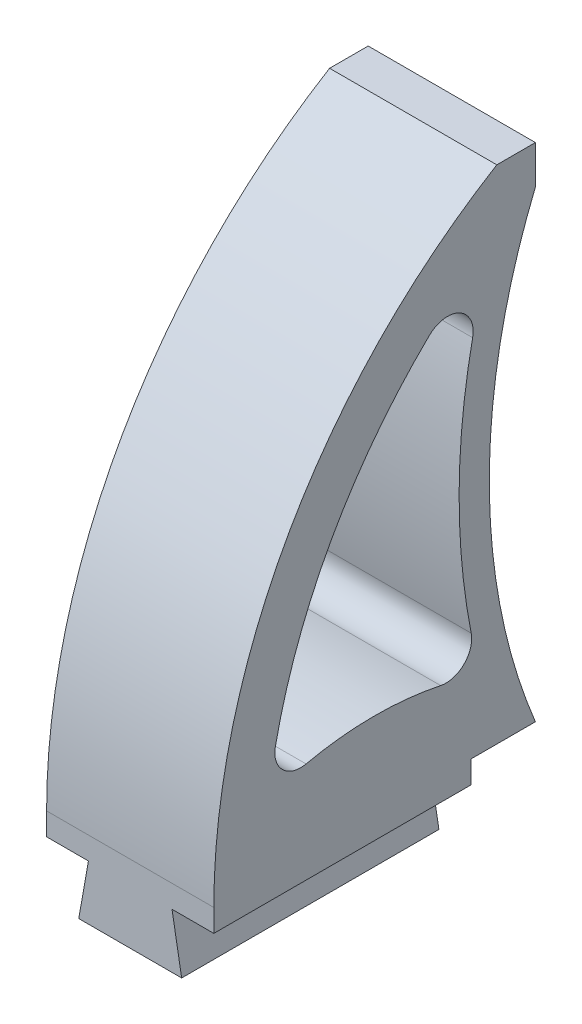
from build123d import *

# Parameters (mm, degrees)
EXTRUDE_1_DEPTH     = 6.5
CUT_EXTRUDE_1_DEPTH = 50.070826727
CUT_EXTRUDE_2_DEPTH = 49.059297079


with BuildPart() as part:
    # Sketch 1 → Extrude 1 (new, symmetric)
    with BuildSketch(Plane(origin=(0, 0, 0), x_dir=(0, 0, -1), z_dir=(1, 0, 0))):
        with BuildLine():
            Line((-20, -3.278350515), (-20, 2.721649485))
            ThreePointArc((-20, 2.721649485), (-14.12072336, 25.110262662), (2, 41.721649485))
            Line((2, 41.721649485), (5, 41.721649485))
            Line((5, 41.721649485), (5, 38.721649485))
            ThreePointArc((5, 38.721649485), (1.416586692, 20.721649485), (5, 2.721649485))
            Line((5, 2.721649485), (0, 2.721649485))
            Line((0, 2.721649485), (0, -3.278350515))
            Line((0, -3.278350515), (-20, -3.278350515))
        make_face()
    extrude(amount=EXTRUDE_1_DEPTH, both=True)

    # Sketch 4 → Cut-Extrude 1 (cut, through all)
    with BuildSketch(Plane.XY.offset(20)):
        Polygon((-6.5, -3.278350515), (-4, -3.278350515), (-3.25, 0.975110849), (-6.5, 0.975110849), align=None)
        Polygon((6.5, 0.975110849), (3.25, 0.975110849), (4, -3.278350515), (6.5, -3.278350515), align=None)
    extrude(amount=-CUT_EXTRUDE_1_DEPTH, mode=Mode.SUBTRACT)

    # Sketch 5 → Cut-Extrude 2 (cut, through all)
    with BuildSketch(Plane(origin=(6.5, 0, 0), x_dir=(0, 0, -1), z_dir=(1, 0, 0))):
        with BuildLine():
            ThreePointArc((-12.830263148, 8.800744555), (-7.599723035, 9.375388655), (-2.36476499, 8.842490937))
            ThreePointArc((-2.36476499, 8.842490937), (-0.54885061, 9.376570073), (0.008524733, 11.185469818))
            ThreePointArc((0.008524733, 11.185469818), (-0.928892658, 21.110663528), (0.121422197, 31.024545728))
            ThreePointArc((0.121422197, 31.024545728), (-0.869135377, 33.182951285), (-3.22370373, 32.873230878))
            ThreePointArc((-3.22370373, 32.873230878), (-10.858536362, 22.922772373), (-15.214862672, 11.161619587))
            ThreePointArc((-15.214862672, 11.161619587), (-14.663809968, 9.333491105), (-12.830263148, 8.800744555))
        make_face()
    extrude(amount=-CUT_EXTRUDE_2_DEPTH, mode=Mode.SUBTRACT)


solid = part.part
